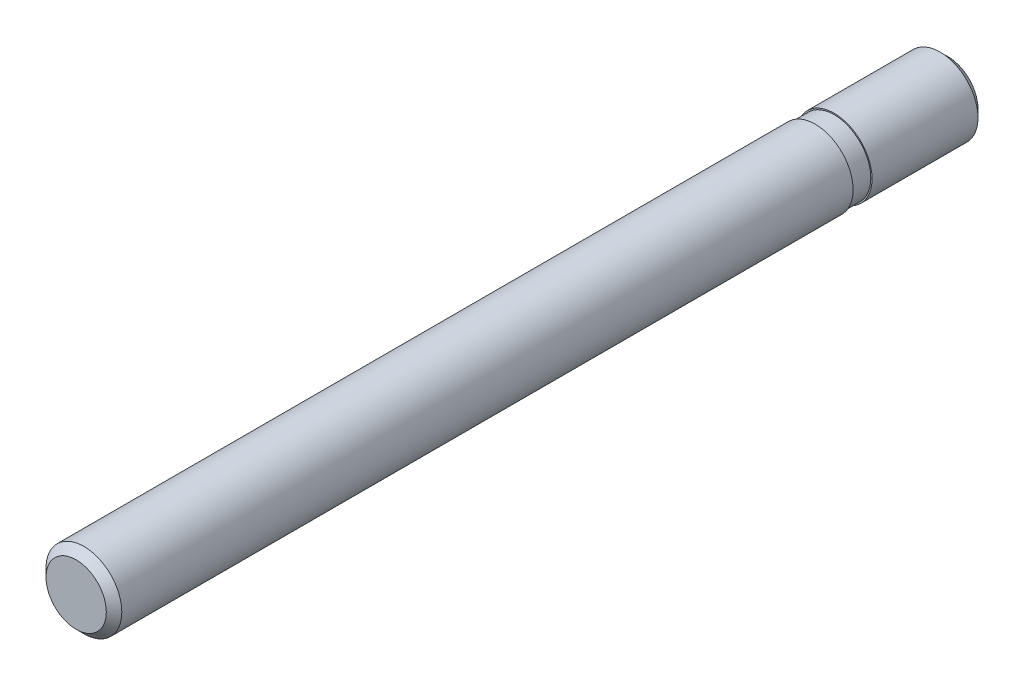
ISO-10303-21;
HEADER;
FILE_DESCRIPTION(('STEP AP214'),'2;1');
FILE_NAME('part.step','',(''),(''),'','','');
FILE_SCHEMA(('AUTOMOTIVE_DESIGN { 1 0 10303 214 1 1 1 1 }'));
ENDSEC;
DATA;
#1=APPLICATION_CONTEXT('core data for automotive mechanical design processes');
#2=APPLICATION_PROTOCOL_DEFINITION('international standard','automotive_design',2000,#1);
#3=PRODUCT_CONTEXT('',#1,'mechanical');
#4=PRODUCT('Part','Part','',(#3));
#5=PRODUCT_RELATED_PRODUCT_CATEGORY('part','',(#4));
#6=PRODUCT_DEFINITION_FORMATION('','',#4);
#7=PRODUCT_DEFINITION_CONTEXT('part definition',#1,'design');
#8=PRODUCT_DEFINITION('design','',#6,#7);
#9=PRODUCT_DEFINITION_SHAPE('','',#8);
#10=(LENGTH_UNIT() NAMED_UNIT(*) SI_UNIT(.MILLI.,.METRE.));
#11=(NAMED_UNIT(*) PLANE_ANGLE_UNIT() SI_UNIT($,.RADIAN.));
#12=(NAMED_UNIT(*) SI_UNIT($,.STERADIAN.) SOLID_ANGLE_UNIT());
#13=UNCERTAINTY_MEASURE_WITH_UNIT(LENGTH_MEASURE(1.E-05),#10,'distance_accuracy_value','');
#14=(GEOMETRIC_REPRESENTATION_CONTEXT(3) GLOBAL_UNCERTAINTY_ASSIGNED_CONTEXT((#13)) GLOBAL_UNIT_ASSIGNED_CONTEXT((#10,
#11,#12)) REPRESENTATION_CONTEXT('',''));
#15=CARTESIAN_POINT('',(0.,0.,0.));
#16=DIRECTION('',(0.,0.,1.));
#17=DIRECTION('',(1.,0.,0.));
#18=AXIS2_PLACEMENT_3D('',#15,#16,#17);
#19=CARTESIAN_POINT('',(0.,1.19325,-9.));
#20=DIRECTION('',(0.,0.,-1.));
#21=DIRECTION('',(-1.,0.,0.));
#22=AXIS2_PLACEMENT_3D('',#19,#20,#21);
#23=PLANE('',#22);
#24=CARTESIAN_POINT('',(0.,0.,-9.));
#25=DIRECTION('',(0.,0.,1.));
#26=DIRECTION('',(1.,0.,0.));
#27=AXIS2_PLACEMENT_3D('',#24,#25,#26);
#28=CIRCLE('',#27,2.38649999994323);
#29=CARTESIAN_POINT('',(2.38649999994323,0.,-9.));
#30=VERTEX_POINT('',#29);
#31=EDGE_CURVE('E19',#30,#30,#28,.T.);
#32=ORIENTED_EDGE('',*,*,#31,.F.);
#33=EDGE_LOOP('',(#32));
#34=FACE_BOUND('',#33,.T.);
#35=ADVANCED_FACE('F12',(#34),#23,.T.);
#36=CARTESIAN_POINT('',(0.,0.,-8.38649999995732));
#37=DIRECTION('',(0.,0.,1.));
#38=DIRECTION('',(1.,0.,0.));
#39=AXIS2_PLACEMENT_3D('',#36,#37,#38);
#40=CONICAL_SURFACE('',#39,2.99999999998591,0.785398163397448);
#41=CARTESIAN_POINT('',(0.,0.,-8.3865));
#42=DIRECTION('',(0.,0.,1.));
#43=DIRECTION('',(1.,0.,0.));
#44=AXIS2_PLACEMENT_3D('',#41,#42,#43);
#45=CIRCLE('',#44,3.);
#46=CARTESIAN_POINT('',(3.,0.,-8.3865));
#47=VERTEX_POINT('',#46);
#48=EDGE_CURVE('E23',#47,#47,#45,.T.);
#49=ORIENTED_EDGE('',*,*,#48,.F.);
#50=EDGE_LOOP('',(#49));
#51=FACE_BOUND('',#50,.T.);
#52=ORIENTED_EDGE('',*,*,#31,.T.);
#53=EDGE_LOOP('',(#52));
#54=FACE_BOUND('',#53,.T.);
#55=ADVANCED_FACE('F65',(#51,#54),#40,.T.);
#56=CARTESIAN_POINT('',(0.,0.,6.25));
#57=DIRECTION('',(0.,0.,1.));
#58=DIRECTION('',(1.,0.,0.));
#59=AXIS2_PLACEMENT_3D('',#56,#57,#58);
#60=CYLINDRICAL_SURFACE('',#59,3.);
#61=CARTESIAN_POINT('',(0.,0.,0.));
#62=DIRECTION('',(0.,0.,1.));
#63=DIRECTION('',(1.,0.,0.));
#64=AXIS2_PLACEMENT_3D('',#61,#62,#63);
#65=CIRCLE('',#64,3.);
#66=CARTESIAN_POINT('',(3.,0.,0.));
#67=VERTEX_POINT('',#66);
#68=EDGE_CURVE('E28',#67,#67,#65,.T.);
#69=ORIENTED_EDGE('',*,*,#68,.F.);
#70=EDGE_LOOP('',(#69));
#71=FACE_BOUND('',#70,.T.);
#72=ORIENTED_EDGE('',*,*,#48,.T.);
#73=EDGE_LOOP('',(#72));
#74=FACE_BOUND('',#73,.T.);
#75=ADVANCED_FACE('F70',(#71,#74),#60,.T.);
#76=CARTESIAN_POINT('',(0.,0.,0.));
#77=DIRECTION('',(0.,0.,1.));
#78=DIRECTION('',(1.,0.,0.));
#79=AXIS2_PLACEMENT_3D('',#76,#77,#78);
#80=PLANE('',#79);
#81=CARTESIAN_POINT('',(0.,0.,0.));
#82=DIRECTION('',(0.,0.,1.));
#83=DIRECTION('',(1.,0.,0.));
#84=AXIS2_PLACEMENT_3D('',#81,#82,#83);
#85=CIRCLE('',#84,2.9);
#86=CARTESIAN_POINT('',(2.9,0.,0.));
#87=VERTEX_POINT('',#86);
#88=EDGE_CURVE('E8',#87,#87,#85,.T.);
#89=ORIENTED_EDGE('',*,*,#88,.F.);
#90=EDGE_LOOP('',(#89));
#91=FACE_BOUND('',#90,.T.);
#92=ORIENTED_EDGE('',*,*,#68,.T.);
#93=EDGE_LOOP('',(#92));
#94=FACE_BOUND('',#93,.T.);
#95=ADVANCED_FACE('F75',(#91,#94),#80,.T.);
#96=CARTESIAN_POINT('',(0.,0.,-1.79129647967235));
#97=DIRECTION('',(0.,0.,-1.));
#98=DIRECTION('',(-1.,0.,0.));
#99=AXIS2_PLACEMENT_3D('',#96,#97,#98);
#100=CYLINDRICAL_SURFACE('',#99,2.9);
#101=CARTESIAN_POINT('',(0.,0.,1.5));
#102=DIRECTION('',(0.,0.,-1.));
#103=DIRECTION('',(-1.,0.,0.));
#104=AXIS2_PLACEMENT_3D('',#101,#102,#103);
#105=CIRCLE('',#104,2.9);
#106=CARTESIAN_POINT('',(-2.9,0.,1.5));
#107=VERTEX_POINT('',#106);
#108=EDGE_CURVE('E44',#107,#107,#105,.T.);
#109=ORIENTED_EDGE('',*,*,#108,.T.);
#110=EDGE_LOOP('',(#109));
#111=FACE_BOUND('',#110,.T.);
#112=ORIENTED_EDGE('',*,*,#88,.T.);
#113=EDGE_LOOP('',(#112));
#114=FACE_BOUND('',#113,.T.);
#115=ADVANCED_FACE('F51',(#111,#114),#100,.T.);
#116=CARTESIAN_POINT('',(0.,0.,60.));
#117=DIRECTION('',(0.,0.,1.));
#118=DIRECTION('',(1.,0.,0.));
#119=AXIS2_PLACEMENT_3D('',#116,#117,#118);
#120=PLANE('',#119);
#121=CARTESIAN_POINT('',(0.,0.,60.));
#122=DIRECTION('',(0.,0.,1.));
#123=DIRECTION('',(1.,0.,0.));
#124=AXIS2_PLACEMENT_3D('',#121,#122,#123);
#125=CIRCLE('',#124,2.3865);
#126=CARTESIAN_POINT('',(2.3865,0.,60.));
#127=VERTEX_POINT('',#126);
#128=EDGE_CURVE('E40',#127,#127,#125,.T.);
#129=ORIENTED_EDGE('',*,*,#128,.T.);
#130=EDGE_LOOP('',(#129));
#131=FACE_BOUND('',#130,.T.);
#132=ADVANCED_FACE('F82',(#131),#120,.T.);
#133=CARTESIAN_POINT('',(0.,0.,60.));
#134=DIRECTION('',(0.,0.,-1.));
#135=DIRECTION('',(-1.,0.,0.));
#136=AXIS2_PLACEMENT_3D('',#133,#134,#135);
#137=CONICAL_SURFACE('',#136,2.3865,0.785398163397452);
#138=CARTESIAN_POINT('',(0.,0.,59.3865));
#139=DIRECTION('',(0.,0.,1.));
#140=DIRECTION('',(1.,0.,0.));
#141=AXIS2_PLACEMENT_3D('',#138,#139,#140);
#142=CIRCLE('',#141,3.);
#143=CARTESIAN_POINT('',(3.,0.,59.3865));
#144=VERTEX_POINT('',#143);
#145=EDGE_CURVE('E31',#144,#144,#142,.F.);
#146=ORIENTED_EDGE('',*,*,#145,.F.);
#147=EDGE_LOOP('',(#146));
#148=FACE_BOUND('',#147,.T.);
#149=ORIENTED_EDGE('',*,*,#128,.F.);
#150=EDGE_LOOP('',(#149));
#151=FACE_BOUND('',#150,.T.);
#152=ADVANCED_FACE('F61',(#148,#151),#137,.T.);
#153=CARTESIAN_POINT('',(0.,0.,6.25));
#154=DIRECTION('',(0.,0.,1.));
#155=DIRECTION('',(1.,0.,0.));
#156=AXIS2_PLACEMENT_3D('',#153,#154,#155);
#157=CYLINDRICAL_SURFACE('',#156,3.);
#158=CARTESIAN_POINT('',(0.,0.,1.5));
#159=DIRECTION('',(0.,0.,1.));
#160=DIRECTION('',(1.,0.,0.));
#161=AXIS2_PLACEMENT_3D('',#158,#159,#160);
#162=CIRCLE('',#161,3.);
#163=CARTESIAN_POINT('',(3.,0.,1.5));
#164=VERTEX_POINT('',#163);
#165=EDGE_CURVE('E35',#164,#164,#162,.T.);
#166=ORIENTED_EDGE('',*,*,#165,.T.);
#167=EDGE_LOOP('',(#166));
#168=FACE_BOUND('',#167,.T.);
#169=ORIENTED_EDGE('',*,*,#145,.T.);
#170=EDGE_LOOP('',(#169));
#171=FACE_BOUND('',#170,.T.);
#172=ADVANCED_FACE('F14',(#168,#171),#157,.T.);
#173=CARTESIAN_POINT('',(0.,0.,1.5));
#174=DIRECTION('',(0.,0.,1.));
#175=DIRECTION('',(1.,0.,0.));
#176=AXIS2_PLACEMENT_3D('',#173,#174,#175);
#177=PLANE('',#176);
#178=ORIENTED_EDGE('',*,*,#108,.F.);
#179=EDGE_LOOP('',(#178));
#180=FACE_BOUND('',#179,.T.);
#181=ORIENTED_EDGE('',*,*,#165,.F.);
#182=EDGE_LOOP('',(#181));
#183=FACE_BOUND('',#182,.T.);
#184=ADVANCED_FACE('F53',(#180,#183),#177,.F.);
#185=CLOSED_SHELL('',(#35,#55,#75,#95,#115,#132,#152,#172,#184));
#186=MANIFOLD_SOLID_BREP('B1',#185);
#187=ADVANCED_BREP_SHAPE_REPRESENTATION('',(#18,#186),#14);
#188=SHAPE_DEFINITION_REPRESENTATION(#9,#187);
ENDSEC;
END-ISO-10303-21;
